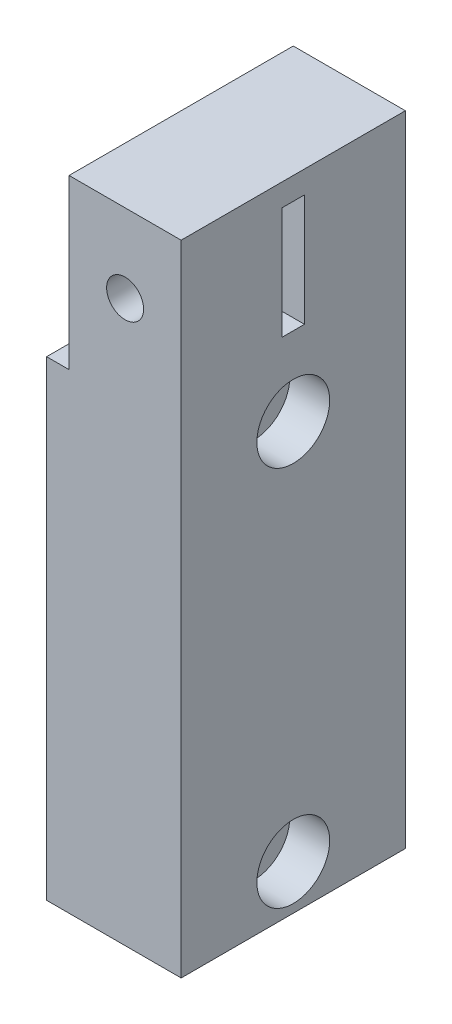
from build123d import *

# Parameters (mm, degrees)
EXTRUDE_1_DEPTH          = 20
SKETCH_2_OUTSIDE_W       = 34.318
SKETCH_2_OUTSIDE_H       = 71.318
SKETCH_2_OUTSIDE_W_2     = 20
SKETCH_2_OUTSIDE_H_2     = 57
SKETCH_2_OUTSIDE_R       = 1.75
SKETCH_2_OUTSIDE_W_3     = 2
SKETCH_2_OUTSIDE_H_3     = 10
CUT_EXTRUDE_1_DEPTH      = 20
SKETCH_3_R               = 3.25
CUT_EXTRUDE_2_DEPTH      = 3.56
CUT_EXTRUDE_3_DEPTH      = 62.587336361
CUT_EXTRUDE_3_DEPTH_BACK = 62.587336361
SKETCH_5_R               = 1.65
CUT_EXTRUDE_4_DEPTH      = 62.587336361


with BuildPart() as part:
    # Sketch 1 → Extrude 1 (new body)
    with BuildSketch(Plane.XY):
        Polygon((12, 0), (12, 57), (2, 57), (2, 42), (0, 42), (0, 0), align=None)
    extrude(amount=EXTRUDE_1_DEPTH)

    # Sketch 2 outside → Cut-Extrude 1 (cut)
    # profile 1 of 4: a face of its own
    with BuildSketch(Plane(origin=(12, 0, 0), x_dir=(0, 0, -1), z_dir=(1, 0, 0))):
        with Locations((-10, 28.5)):
            Rectangle(SKETCH_2_OUTSIDE_W, SKETCH_2_OUTSIDE_H)
        with Locations((-10, 28.5)):
            Rectangle(SKETCH_2_OUTSIDE_W_2, SKETCH_2_OUTSIDE_H_2, mode=Mode.SUBTRACT)
    # profile 2 of 4: a face of its own
    with BuildSketch(Plane(origin=(12, 0, 0), x_dir=(0, 0, -1), z_dir=(1, 0, 0))):
        with Locations((-10, 38)):
            Circle(SKETCH_2_OUTSIDE_R)
    # profile 3 of 4: a face of its own
    with BuildSketch(Plane(origin=(12, 0, 0), x_dir=(0, 0, -1), z_dir=(1, 0, 0))):
        with Locations((-10, 4)):
            Circle(SKETCH_2_OUTSIDE_R)
    # profile 4 of 4: a face of its own
    with BuildSketch(Plane(origin=(12, 0, 0), x_dir=(0, 0, -1), z_dir=(1, 0, 0))):
        with Locations((-10, 50)):
            Rectangle(SKETCH_2_OUTSIDE_W_3, SKETCH_2_OUTSIDE_H_3)
    extrude(amount=-CUT_EXTRUDE_1_DEPTH, mode=Mode.SUBTRACT)

    # Sketch 3 → Cut-Extrude 2 (cut)
    with BuildSketch(Plane(origin=(12, 0, 0), x_dir=(0, 0, -1), z_dir=(1, 0, 0))):
        with Locations((-10, 38)):
            Circle(SKETCH_3_R)
        with Locations((-10, 4)):
            Circle(SKETCH_3_R)
    extrude(amount=-CUT_EXTRUDE_2_DEPTH, mode=Mode.SUBTRACT)

    # Sketch 4 → Cut-Extrude 3 (cut, two sides: drawn at the far end of the back side and taken through both)
    with BuildSketch(Plane(origin=(0, 57, 0), x_dir=(1, 0, 0), z_dir=(0, 1, 0)).offset(-CUT_EXTRUDE_3_DEPTH_BACK)):
        Polygon((-53.266615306, -2), (0, -2), (2, -2), (2, -18), (0, -18), (-53.266615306, -18), (-159.799845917, -18), (-159.799845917, -2), align=None)
    extrude(amount=CUT_EXTRUDE_3_DEPTH + CUT_EXTRUDE_3_DEPTH_BACK, mode=Mode.SUBTRACT)

    # Sketch 5 → Cut-Extrude 4 (cut, through all)
    with BuildSketch(Plane.XY.offset(20)):
        with Locations((7, 50)):
            Circle(SKETCH_5_R)
    extrude(amount=-CUT_EXTRUDE_4_DEPTH, mode=Mode.SUBTRACT)


solid = part.part
